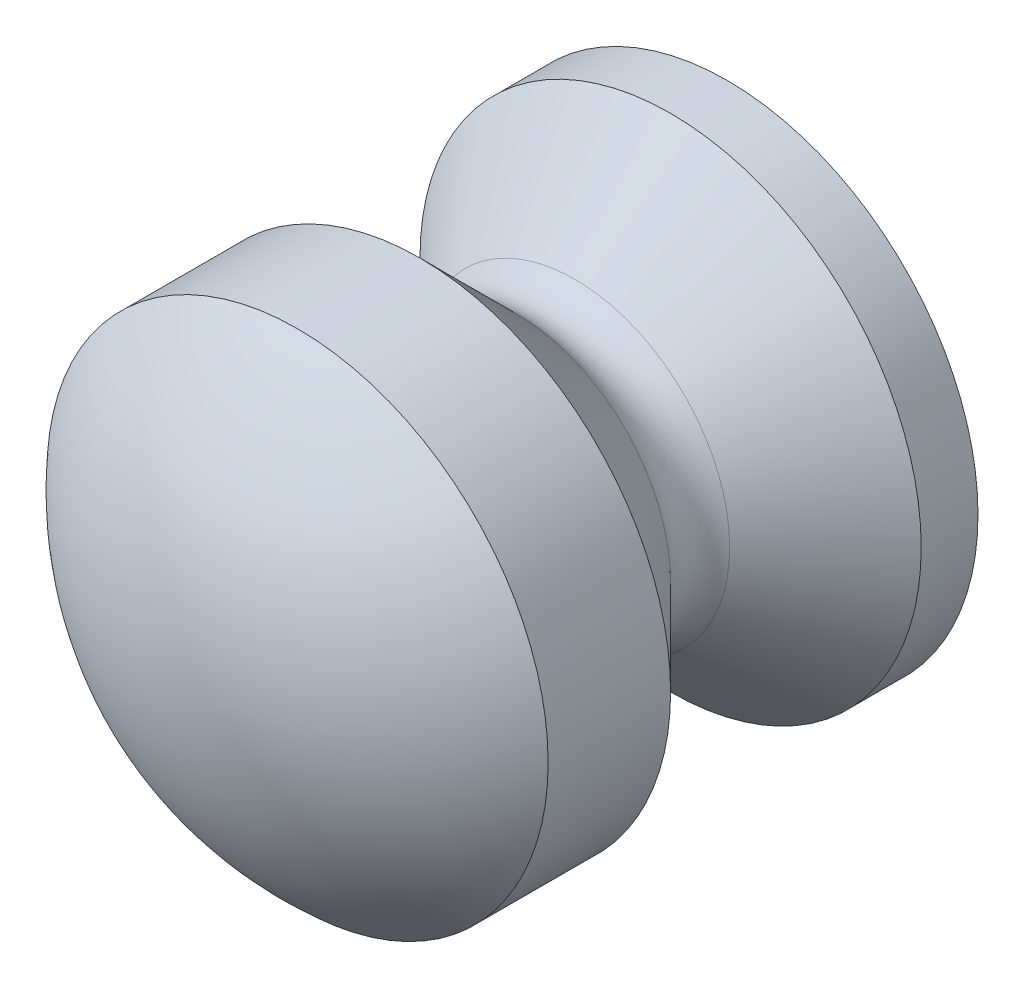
from build123d import *


with BuildPart() as part:
    # Sketch 1 → Revolve 1 (revolve)
    with BuildSketch(Plane(origin=(0, 0, 0), x_dir=(0, 0, -1), z_dir=(1, 0, 0)), mode=Mode.PRIVATE) as revolve_1_sk:
        with BuildLine():
            Line((2.149869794, 4.7625), (4.47675, 4.7625))
            Line((4.47675, 4.7625), (6.296733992, 2.942516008))
            ThreePointArc((6.296733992, 2.942516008), (6.858, 2.710032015), (7.419266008, 2.942516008))
            Line((7.419266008, 2.942516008), (9.23925, 4.7625))
            Line((9.23925, 4.7625), (10.31875, 4.7625))
            Line((10.31875, 4.7625), (10.31875, 0))
            Line((10.31875, 0), (0, 0))
            ThreePointArc((0, 0), (0.562369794, 2.612630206), (2.149869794, 4.7625))
        make_face()
    revolve(revolve_1_sk.sketch.rotate(Axis((0, 0, 0), (0, 0, -1)), 90), axis=Axis((0, 0, 0), (0, 0, -1)))


solid = part.part
